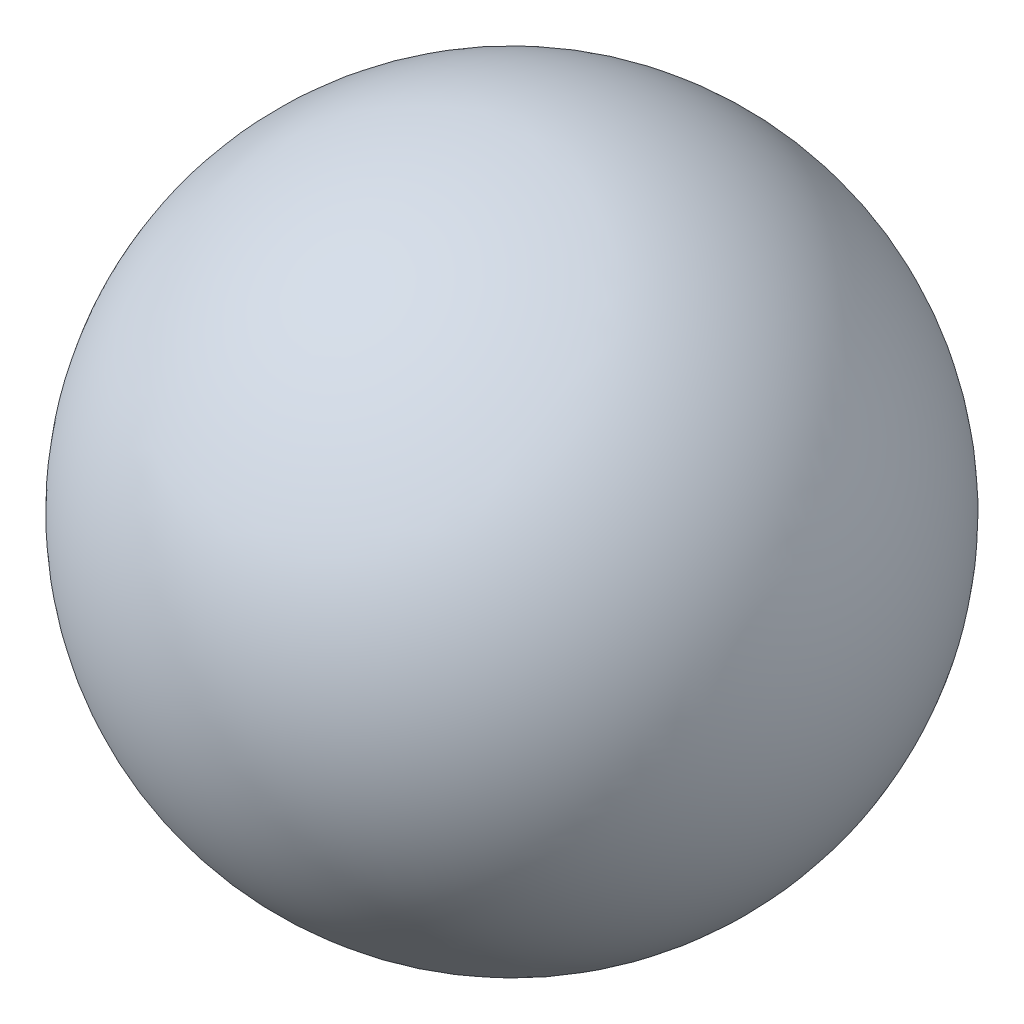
from build123d import *

# Parameters (mm, degrees)
CROQUIS2_R            = 7.5
CORTAR_EXTRUIR1_DEPTH = 26.980762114


with BuildPart() as part:
    # Croquis1 → Revoluci_n1 (revolve)
    with BuildSketch(Plane(origin=(0, 0, 0), x_dir=(0, 0, -1), z_dir=(1, 0, 0))):
        with BuildLine():
            Line((15, 0), (-15, 0))
            ThreePointArc((-15, 0), (0, 15), (15, 0))
        make_face()
    revolve(axis=Axis((0, 0, -15), (0, 0, 1)))

    # Croquis2 → Cortar-Extruir1 (cut, through all)
    with BuildSketch(Plane(origin=(0, 0, 0), x_dir=(0, 0, -1), z_dir=(1, 0, 0))):
        Circle(CROQUIS2_R)
    extrude(amount=-CORTAR_EXTRUIR1_DEPTH, mode=Mode.SUBTRACT)


solid = part.part
